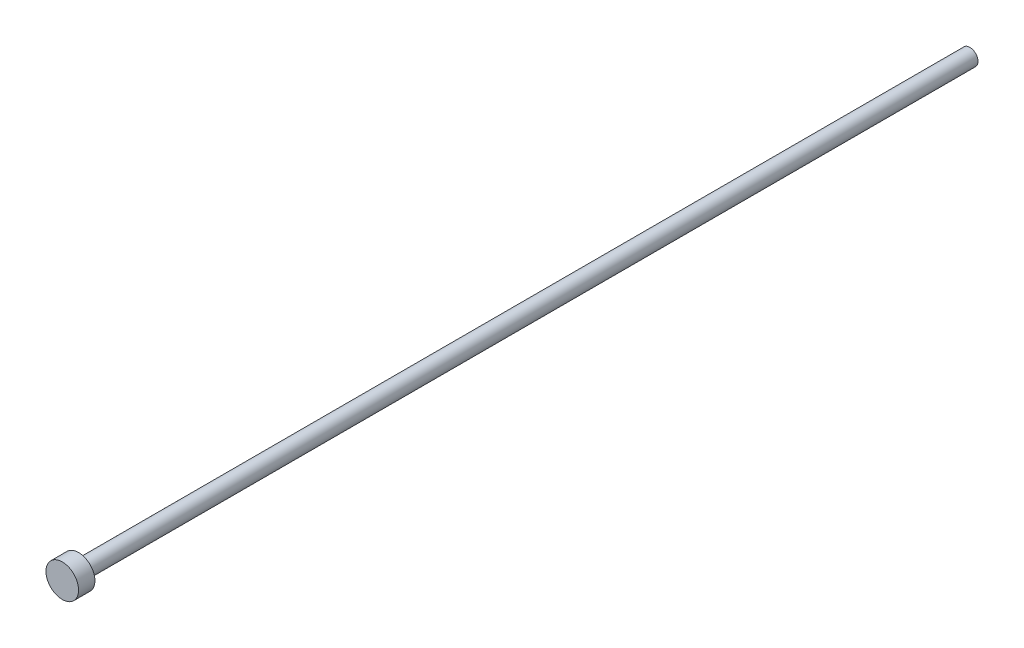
ISO-10303-21;
HEADER;
FILE_DESCRIPTION(('STEP AP214'),'2;1');
FILE_NAME('part.step','',(''),(''),'','','');
FILE_SCHEMA(('AUTOMOTIVE_DESIGN { 1 0 10303 214 1 1 1 1 }'));
ENDSEC;
DATA;
#1=APPLICATION_CONTEXT('core data for automotive mechanical design processes');
#2=APPLICATION_PROTOCOL_DEFINITION('international standard','automotive_design',2000,#1);
#3=PRODUCT_CONTEXT('',#1,'mechanical');
#4=PRODUCT('Part','Part','',(#3));
#5=PRODUCT_RELATED_PRODUCT_CATEGORY('part','',(#4));
#6=PRODUCT_DEFINITION_FORMATION('','',#4);
#7=PRODUCT_DEFINITION_CONTEXT('part definition',#1,'design');
#8=PRODUCT_DEFINITION('design','',#6,#7);
#9=PRODUCT_DEFINITION_SHAPE('','',#8);
#10=(LENGTH_UNIT() NAMED_UNIT(*) SI_UNIT(.MILLI.,.METRE.));
#11=(NAMED_UNIT(*) PLANE_ANGLE_UNIT() SI_UNIT($,.RADIAN.));
#12=(NAMED_UNIT(*) SI_UNIT($,.STERADIAN.) SOLID_ANGLE_UNIT());
#13=UNCERTAINTY_MEASURE_WITH_UNIT(LENGTH_MEASURE(1.E-05),#10,'distance_accuracy_value','');
#14=(GEOMETRIC_REPRESENTATION_CONTEXT(3) GLOBAL_UNCERTAINTY_ASSIGNED_CONTEXT((#13)) GLOBAL_UNIT_ASSIGNED_CONTEXT((#10,
#11,#12)) REPRESENTATION_CONTEXT('',''));
#15=CARTESIAN_POINT('',(0.,0.,0.));
#16=DIRECTION('',(0.,0.,1.));
#17=DIRECTION('',(1.,0.,0.));
#18=AXIS2_PLACEMENT_3D('',#15,#16,#17);
#19=CARTESIAN_POINT('',(0.,0.,-2.));
#20=DIRECTION('',(0.,0.,1.));
#21=DIRECTION('',(1.,0.,0.));
#22=AXIS2_PLACEMENT_3D('',#19,#20,#21);
#23=PLANE('',#22);
#24=CARTESIAN_POINT('',(0.,0.,-2.));
#25=DIRECTION('',(0.,0.,1.));
#26=DIRECTION('',(1.,0.,0.));
#27=AXIS2_PLACEMENT_3D('',#24,#25,#26);
#28=CIRCLE('',#27,1.2);
#29=CARTESIAN_POINT('',(1.2,0.,-2.));
#30=VERTEX_POINT('',#29);
#31=EDGE_CURVE('E11',#30,#30,#28,.T.);
#32=ORIENTED_EDGE('',*,*,#31,.T.);
#33=EDGE_LOOP('',(#32));
#34=FACE_BOUND('',#33,.T.);
#35=CARTESIAN_POINT('',(0.,0.,-2.));
#36=DIRECTION('',(0.,0.,1.));
#37=DIRECTION('',(1.,0.,0.));
#38=AXIS2_PLACEMENT_3D('',#35,#36,#37);
#39=CIRCLE('',#38,2.);
#40=CARTESIAN_POINT('',(2.,0.,-2.));
#41=VERTEX_POINT('',#40);
#42=EDGE_CURVE('E40',#41,#41,#39,.T.);
#43=ORIENTED_EDGE('',*,*,#42,.F.);
#44=EDGE_LOOP('',(#43));
#45=FACE_BOUND('',#44,.T.);
#46=ADVANCED_FACE('F29',(#34,#45),#23,.F.);
#47=CARTESIAN_POINT('',(0.,0.,-2.));
#48=DIRECTION('',(0.,0.,1.));
#49=DIRECTION('',(1.,0.,0.));
#50=AXIS2_PLACEMENT_3D('',#47,#48,#49);
#51=CYLINDRICAL_SURFACE('',#50,2.);
#52=ORIENTED_EDGE('',*,*,#42,.T.);
#53=EDGE_LOOP('',(#52));
#54=FACE_BOUND('',#53,.T.);
#55=CARTESIAN_POINT('',(0.,0.,0.));
#56=DIRECTION('',(0.,0.,1.));
#57=DIRECTION('',(1.,0.,0.));
#58=AXIS2_PLACEMENT_3D('',#55,#56,#57);
#59=CIRCLE('',#58,2.);
#60=CARTESIAN_POINT('',(2.,0.,0.));
#61=VERTEX_POINT('',#60);
#62=EDGE_CURVE('E44',#61,#61,#59,.T.);
#63=ORIENTED_EDGE('',*,*,#62,.F.);
#64=EDGE_LOOP('',(#63));
#65=FACE_BOUND('',#64,.T.);
#66=ADVANCED_FACE('F31',(#54,#65),#51,.T.);
#67=CARTESIAN_POINT('',(0.,0.,0.));
#68=DIRECTION('',(0.,0.,1.));
#69=DIRECTION('',(1.,0.,0.));
#70=AXIS2_PLACEMENT_3D('',#67,#68,#69);
#71=PLANE('',#70);
#72=ORIENTED_EDGE('',*,*,#62,.T.);
#73=EDGE_LOOP('',(#72));
#74=FACE_BOUND('',#73,.T.);
#75=ADVANCED_FACE('F58',(#74),#71,.T.);
#76=CARTESIAN_POINT('',(0.,0.,-252.828427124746));
#77=DIRECTION('',(0.,0.,1.));
#78=DIRECTION('',(1.,0.,0.));
#79=AXIS2_PLACEMENT_3D('',#76,#77,#78);
#80=CYLINDRICAL_SURFACE('',#79,1.);
#81=CARTESIAN_POINT('',(0.,0.,-111.30925));
#82=DIRECTION('',(0.,0.,1.));
#83=DIRECTION('',(1.,0.,0.));
#84=AXIS2_PLACEMENT_3D('',#81,#82,#83);
#85=CIRCLE('',#84,1.);
#86=CARTESIAN_POINT('',(1.,0.,-111.30925));
#87=VERTEX_POINT('',#86);
#88=EDGE_CURVE('E49',#87,#87,#85,.F.);
#89=ORIENTED_EDGE('',*,*,#88,.F.);
#90=EDGE_LOOP('',(#89));
#91=FACE_BOUND('',#90,.T.);
#92=CARTESIAN_POINT('',(0.,0.,-2.19999999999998));
#93=DIRECTION('',(0.,0.,1.));
#94=DIRECTION('',(1.,0.,0.));
#95=AXIS2_PLACEMENT_3D('',#92,#93,#94);
#96=CIRCLE('',#95,1.);
#97=CARTESIAN_POINT('',(1.,0.,-2.19999999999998));
#98=VERTEX_POINT('',#97);
#99=EDGE_CURVE('E36',#98,#98,#96,.F.);
#100=ORIENTED_EDGE('',*,*,#99,.T.);
#101=EDGE_LOOP('',(#100));
#102=FACE_BOUND('',#101,.T.);
#103=ADVANCED_FACE('F55',(#91,#102),#80,.T.);
#104=CARTESIAN_POINT('',(0.,0.,-2.19999999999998));
#105=DIRECTION('',(0.,0.,1.));
#106=DIRECTION('',(1.,0.,0.));
#107=AXIS2_PLACEMENT_3D('',#104,#105,#106);
#108=TOROIDAL_SURFACE('',#107,1.2,0.2);
#109=ORIENTED_EDGE('',*,*,#31,.F.);
#110=EDGE_LOOP('',(#109));
#111=FACE_BOUND('',#110,.T.);
#112=ORIENTED_EDGE('',*,*,#99,.F.);
#113=EDGE_LOOP('',(#112));
#114=FACE_BOUND('',#113,.T.);
#115=ADVANCED_FACE('F57',(#111,#114),#108,.F.);
#116=CARTESIAN_POINT('',(-0.0374264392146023,-3.9055,-111.30925));
#117=DIRECTION('',(0.,0.,1.));
#118=DIRECTION('',(1.,0.,0.));
#119=AXIS2_PLACEMENT_3D('',#116,#117,#118);
#120=PLANE('',#119);
#121=ORIENTED_EDGE('',*,*,#88,.T.);
#122=EDGE_LOOP('',(#121));
#123=FACE_BOUND('',#122,.T.);
#124=ADVANCED_FACE('F53',(#123),#120,.F.);
#125=CLOSED_SHELL('',(#46,#66,#75,#103,#115,#124));
#126=MANIFOLD_SOLID_BREP('B2',#125);
#127=ADVANCED_BREP_SHAPE_REPRESENTATION('',(#18,#126),#14);
#128=SHAPE_DEFINITION_REPRESENTATION(#9,#127);
ENDSEC;
END-ISO-10303-21;
